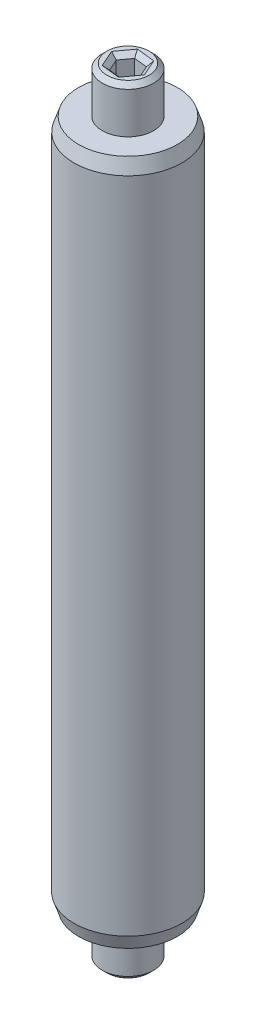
ISO-10303-21;
HEADER;
FILE_DESCRIPTION(('STEP AP214'),'2;1');
FILE_NAME('part.step','',(''),(''),'','','');
FILE_SCHEMA(('AUTOMOTIVE_DESIGN { 1 0 10303 214 1 1 1 1 }'));
ENDSEC;
DATA;
#1=APPLICATION_CONTEXT('core data for automotive mechanical design processes');
#2=APPLICATION_PROTOCOL_DEFINITION('international standard','automotive_design',2000,#1);
#3=PRODUCT_CONTEXT('',#1,'mechanical');
#4=PRODUCT('Part','Part','',(#3));
#5=PRODUCT_RELATED_PRODUCT_CATEGORY('part','',(#4));
#6=PRODUCT_DEFINITION_FORMATION('','',#4);
#7=PRODUCT_DEFINITION_CONTEXT('part definition',#1,'design');
#8=PRODUCT_DEFINITION('design','',#6,#7);
#9=PRODUCT_DEFINITION_SHAPE('','',#8);
#10=(LENGTH_UNIT() NAMED_UNIT(*) SI_UNIT(.MILLI.,.METRE.));
#11=(NAMED_UNIT(*) PLANE_ANGLE_UNIT() SI_UNIT($,.RADIAN.));
#12=(NAMED_UNIT(*) SI_UNIT($,.STERADIAN.) SOLID_ANGLE_UNIT());
#13=UNCERTAINTY_MEASURE_WITH_UNIT(LENGTH_MEASURE(1.E-05),#10,'distance_accuracy_value','');
#14=(GEOMETRIC_REPRESENTATION_CONTEXT(3) GLOBAL_UNCERTAINTY_ASSIGNED_CONTEXT((#13)) GLOBAL_UNIT_ASSIGNED_CONTEXT((#10,
#11,#12)) REPRESENTATION_CONTEXT('',''));
#15=CARTESIAN_POINT('',(0.,0.,0.));
#16=DIRECTION('',(0.,0.,1.));
#17=DIRECTION('',(1.,0.,0.));
#18=AXIS2_PLACEMENT_3D('',#15,#16,#17);
#19=CARTESIAN_POINT('',(-1.06592274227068,21.5359369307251,-1.12643595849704));
#20=DIRECTION('',(0.,-1.,0.));
#21=DIRECTION('',(0.,0.,-1.));
#22=AXIS2_PLACEMENT_3D('',#19,#20,#21);
#23=PLANE('',#22);
#24=CARTESIAN_POINT('',(-1.06592274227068,21.5359369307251,-1.12643595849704));
#25=DIRECTION('',(0.,-1.,0.));
#26=DIRECTION('',(0.,0.,-1.));
#27=AXIS2_PLACEMENT_3D('',#24,#25,#26);
#28=CIRCLE('',#27,1.3843);
#29=CARTESIAN_POINT('',(-1.06592274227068,21.5359369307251,-2.51073595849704));
#30=VERTEX_POINT('',#29);
#31=EDGE_CURVE('P0_E11',#30,#30,#28,.T.);
#32=ORIENTED_EDGE('',*,*,#31,.T.);
#33=EDGE_LOOP('',(#32));
#34=FACE_BOUND('',#33,.T.);
#35=CARTESIAN_POINT('',(-1.06592274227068,21.5359369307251,-1.12643595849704));
#36=DIRECTION('',(0.,1.,0.));
#37=DIRECTION('',(0.,0.,1.));
#38=AXIS2_PLACEMENT_3D('',#35,#36,#37);
#39=CIRCLE('',#38,2.74319999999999);
#40=CARTESIAN_POINT('',(-1.06592274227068,21.5359369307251,1.61676404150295));
#41=VERTEX_POINT('',#40);
#42=EDGE_CURVE('P0_E54',#41,#41,#39,.T.);
#43=ORIENTED_EDGE('',*,*,#42,.T.);
#44=EDGE_LOOP('',(#43));
#45=FACE_BOUND('',#44,.T.);
#46=ADVANCED_FACE('P0_F16',(#34,#45),#23,.F.);
#47=CARTESIAN_POINT('',(-1.06592274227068,20.7739369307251,-1.12643595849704));
#48=DIRECTION('',(0.,-1.,0.));
#49=DIRECTION('',(0.,0.,-1.));
#50=AXIS2_PLACEMENT_3D('',#47,#48,#49);
#51=CONICAL_SURFACE('',#50,2.9972,0.32175055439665);
#52=ORIENTED_EDGE('',*,*,#42,.F.);
#53=EDGE_LOOP('',(#52));
#54=FACE_BOUND('',#53,.T.);
#55=CARTESIAN_POINT('',(-1.06592274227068,20.7739369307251,-1.12643595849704));
#56=DIRECTION('',(0.,1.,0.));
#57=DIRECTION('',(0.,0.,1.));
#58=AXIS2_PLACEMENT_3D('',#55,#56,#57);
#59=CIRCLE('',#58,2.9972);
#60=CARTESIAN_POINT('',(-1.06592274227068,20.7739369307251,1.87076404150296));
#61=VERTEX_POINT('',#60);
#62=EDGE_CURVE('P0_E51',#61,#61,#59,.T.);
#63=ORIENTED_EDGE('',*,*,#62,.T.);
#64=EDGE_LOOP('',(#63));
#65=FACE_BOUND('',#64,.T.);
#66=ADVANCED_FACE('P0_F75',(#54,#65),#51,.T.);
#67=CARTESIAN_POINT('',(-1.06592274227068,21.5359369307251,-1.12643595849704));
#68=DIRECTION('',(0.,1.,0.));
#69=DIRECTION('',(0.,0.,1.));
#70=AXIS2_PLACEMENT_3D('',#67,#68,#69);
#71=CYLINDRICAL_SURFACE('',#70,2.9972);
#72=ORIENTED_EDGE('',*,*,#62,.F.);
#73=EDGE_LOOP('',(#72));
#74=FACE_BOUND('',#73,.T.);
#75=CARTESIAN_POINT('',(-1.06592274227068,-15.8020630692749,-1.12643595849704));
#76=DIRECTION('',(0.,1.,0.));
#77=DIRECTION('',(0.,0.,1.));
#78=AXIS2_PLACEMENT_3D('',#75,#76,#77);
#79=CIRCLE('',#78,2.9972);
#80=CARTESIAN_POINT('',(-1.06592274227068,-15.8020630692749,1.87076404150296));
#81=VERTEX_POINT('',#80);
#82=EDGE_CURVE('P0_E48',#81,#81,#79,.T.);
#83=ORIENTED_EDGE('',*,*,#82,.T.);
#84=EDGE_LOOP('',(#83));
#85=FACE_BOUND('',#84,.T.);
#86=ADVANCED_FACE('P0_F81',(#74,#85),#71,.T.);
#87=CARTESIAN_POINT('',(-1.06592274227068,-16.5640630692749,-1.12643595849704));
#88=DIRECTION('',(0.,1.,0.));
#89=DIRECTION('',(0.,0.,1.));
#90=AXIS2_PLACEMENT_3D('',#87,#88,#89);
#91=CONICAL_SURFACE('',#90,2.74319999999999,0.321750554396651);
#92=ORIENTED_EDGE('',*,*,#82,.F.);
#93=EDGE_LOOP('',(#92));
#94=FACE_BOUND('',#93,.T.);
#95=CARTESIAN_POINT('',(-1.06592274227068,-16.5640630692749,-1.12643595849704));
#96=DIRECTION('',(0.,1.,0.));
#97=DIRECTION('',(0.,0.,1.));
#98=AXIS2_PLACEMENT_3D('',#95,#96,#97);
#99=CIRCLE('',#98,2.74319999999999);
#100=CARTESIAN_POINT('',(-1.06592274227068,-16.5640630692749,1.61676404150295));
#101=VERTEX_POINT('',#100);
#102=EDGE_CURVE('P0_E43',#101,#101,#99,.T.);
#103=ORIENTED_EDGE('',*,*,#102,.T.);
#104=EDGE_LOOP('',(#103));
#105=FACE_BOUND('',#104,.T.);
#106=ADVANCED_FACE('P0_F88',(#94,#105),#91,.T.);
#107=CARTESIAN_POINT('',(1.67727725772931,-16.5640630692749,-1.12643595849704));
#108=DIRECTION('',(0.,1.,0.));
#109=DIRECTION('',(0.,0.,1.));
#110=AXIS2_PLACEMENT_3D('',#107,#108,#109);
#111=PLANE('',#110);
#112=CARTESIAN_POINT('',(-1.06592274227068,-16.5640630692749,-1.12643595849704));
#113=DIRECTION('',(0.,1.,0.));
#114=DIRECTION('',(0.,0.,1.));
#115=AXIS2_PLACEMENT_3D('',#112,#113,#114);
#116=CIRCLE('',#115,1.3843);
#117=CARTESIAN_POINT('',(-1.06592274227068,-16.5640630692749,0.257864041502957));
#118=VERTEX_POINT('',#117);
#119=EDGE_CURVE('P0_E60',#118,#118,#116,.T.);
#120=ORIENTED_EDGE('',*,*,#119,.T.);
#121=EDGE_LOOP('',(#120));
#122=FACE_BOUND('',#121,.T.);
#123=ORIENTED_EDGE('',*,*,#102,.F.);
#124=EDGE_LOOP('',(#123));
#125=FACE_BOUND('',#124,.T.);
#126=ADVANCED_FACE('P0_F92',(#122,#125),#111,.F.);
#127=CARTESIAN_POINT('',(-1.06592274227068,-16.5640630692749,-1.12643595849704));
#128=DIRECTION('',(0.,-1.,0.));
#129=DIRECTION('',(0.,0.,-1.));
#130=AXIS2_PLACEMENT_3D('',#127,#128,#129);
#131=CYLINDRICAL_SURFACE('',#130,1.1303);
#132=CARTESIAN_POINT('',(-1.06592274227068,-16.1241221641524,-1.12643595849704));
#133=DIRECTION('',(0.,1.,0.));
#134=DIRECTION('',(0.,0.,1.));
#135=AXIS2_PLACEMENT_3D('',#132,#133,#134);
#136=CIRCLE('',#135,1.1303);
#137=CARTESIAN_POINT('',(-1.06592274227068,-16.1241221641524,0.00386404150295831));
#138=VERTEX_POINT('',#137);
#139=EDGE_CURVE('P0_E57',#138,#138,#136,.F.);
#140=ORIENTED_EDGE('',*,*,#139,.T.);
#141=EDGE_LOOP('',(#140));
#142=FACE_BOUND('',#141,.T.);
#143=CARTESIAN_POINT('',(-1.06592274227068,-10.8490630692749,-1.12643595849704));
#144=DIRECTION('',(0.,-1.,0.));
#145=DIRECTION('',(0.,0.,-1.));
#146=AXIS2_PLACEMENT_3D('',#143,#144,#145);
#147=CIRCLE('',#146,1.1303);
#148=CARTESIAN_POINT('',(-1.06592274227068,-10.8490630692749,-2.25673595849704));
#149=VERTEX_POINT('',#148);
#150=EDGE_CURVE('P0_E40',#149,#149,#147,.T.);
#151=ORIENTED_EDGE('',*,*,#150,.F.);
#152=EDGE_LOOP('',(#151));
#153=FACE_BOUND('',#152,.T.);
#154=ADVANCED_FACE('P0_F96',(#142,#153),#131,.F.);
#155=CARTESIAN_POINT('',(-1.06592274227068,-10.8490630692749,-1.12643595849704));
#156=DIRECTION('',(0.,-1.,0.));
#157=DIRECTION('',(0.,0.,-1.));
#158=AXIS2_PLACEMENT_3D('',#155,#156,#157);
#159=CONICAL_SURFACE('',#158,1.1303,1.02974425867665);
#160=CARTESIAN_POINT('',(-1.06592274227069,-10.1699103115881,-1.12643595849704));
#161=VERTEX_POINT('',#160);
#162=VERTEX_LOOP('',#161);
#163=FACE_BOUND('',#162,.T.);
#164=ORIENTED_EDGE('',*,*,#150,.T.);
#165=EDGE_LOOP('',(#164));
#166=FACE_BOUND('',#165,.T.);
#167=ADVANCED_FACE('P0_F100',(#163,#166),#159,.F.);
#168=CARTESIAN_POINT('',(-1.06592274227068,21.5359369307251,-1.12643595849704));
#169=DIRECTION('',(0.,1.,0.));
#170=DIRECTION('',(0.,0.,1.));
#171=AXIS2_PLACEMENT_3D('',#168,#169,#170);
#172=CYLINDRICAL_SURFACE('',#171,1.1303);
#173=CARTESIAN_POINT('',(-1.06592274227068,21.0959960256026,-1.12643595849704));
#174=DIRECTION('',(0.,-1.,0.));
#175=DIRECTION('',(0.,0.,-1.));
#176=AXIS2_PLACEMENT_3D('',#173,#174,#175);
#177=CIRCLE('',#176,1.1303);
#178=CARTESIAN_POINT('',(-1.06592274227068,21.0959960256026,-2.25673595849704));
#179=VERTEX_POINT('',#178);
#180=EDGE_CURVE('P0_E24',#179,#179,#177,.F.);
#181=ORIENTED_EDGE('',*,*,#180,.T.);
#182=EDGE_LOOP('',(#181));
#183=FACE_BOUND('',#182,.T.);
#184=CARTESIAN_POINT('',(-1.06592274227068,15.8209369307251,-1.12643595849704));
#185=DIRECTION('',(0.,1.,0.));
#186=DIRECTION('',(0.,0.,1.));
#187=AXIS2_PLACEMENT_3D('',#184,#185,#186);
#188=CIRCLE('',#187,1.1303);
#189=CARTESIAN_POINT('',(-1.06592274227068,15.8209369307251,0.00386404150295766));
#190=VERTEX_POINT('',#189);
#191=EDGE_CURVE('P0_E38',#190,#190,#188,.T.);
#192=ORIENTED_EDGE('',*,*,#191,.F.);
#193=EDGE_LOOP('',(#192));
#194=FACE_BOUND('',#193,.T.);
#195=ADVANCED_FACE('P0_F34',(#183,#194),#172,.F.);
#196=CARTESIAN_POINT('',(-1.06592274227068,15.8209369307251,-1.12643595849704));
#197=DIRECTION('',(0.,1.,0.));
#198=DIRECTION('',(0.,0.,1.));
#199=AXIS2_PLACEMENT_3D('',#196,#197,#198);
#200=CONICAL_SURFACE('',#199,1.1303,1.02974425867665);
#201=CARTESIAN_POINT('',(-1.06592274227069,15.1417841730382,-1.12643595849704));
#202=VERTEX_POINT('',#201);
#203=VERTEX_LOOP('',#202);
#204=FACE_BOUND('',#203,.T.);
#205=ORIENTED_EDGE('',*,*,#191,.T.);
#206=EDGE_LOOP('',(#205));
#207=FACE_BOUND('',#206,.T.);
#208=ADVANCED_FACE('P0_F30',(#204,#207),#200,.F.);
#209=CARTESIAN_POINT('',(-1.06592274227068,-16.1241221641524,-1.12643595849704));
#210=DIRECTION('',(0.,-1.,0.));
#211=DIRECTION('',(0.,0.,-1.));
#212=AXIS2_PLACEMENT_3D('',#209,#210,#211);
#213=CONICAL_SURFACE('',#212,1.1303,0.523598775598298);
#214=ORIENTED_EDGE('',*,*,#119,.F.);
#215=EDGE_LOOP('',(#214));
#216=FACE_BOUND('',#215,.T.);
#217=ORIENTED_EDGE('',*,*,#139,.F.);
#218=EDGE_LOOP('',(#217));
#219=FACE_BOUND('',#218,.T.);
#220=ADVANCED_FACE('P0_F33',(#216,#219),#213,.F.);
#221=CARTESIAN_POINT('',(-1.06592274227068,21.0959960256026,-1.12643595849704));
#222=DIRECTION('',(0.,1.,0.));
#223=DIRECTION('',(0.,0.,1.));
#224=AXIS2_PLACEMENT_3D('',#221,#222,#223);
#225=CONICAL_SURFACE('',#224,1.1303,0.523598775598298);
#226=ORIENTED_EDGE('',*,*,#31,.F.);
#227=EDGE_LOOP('',(#226));
#228=FACE_BOUND('',#227,.T.);
#229=ORIENTED_EDGE('',*,*,#180,.F.);
#230=EDGE_LOOP('',(#229));
#231=FACE_BOUND('',#230,.T.);
#232=ADVANCED_FACE('P0_F18',(#228,#231),#225,.F.);
#233=CLOSED_SHELL('',(#46,#66,#86,#106,#126,#154,#167,#195,#208,#220,#232));
#234=MANIFOLD_SOLID_BREP('P0_B1',#233);
#235=CARTESIAN_POINT('',(-1.64154912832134,17.7259369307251,-2.42715730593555));
#236=DIRECTION('',(0.,1.,0.));
#237=DIRECTION('',(-0.914455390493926,0.,0.404686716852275));
#238=AXIS2_PLACEMENT_3D('',#235,#236,#237);
#239=PLANE('',#238);
#240=CARTESIAN_POINT('',(-1.06592274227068,17.7259369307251,-1.12643595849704));
#241=DIRECTION('',(0.,1.,0.));
#242=DIRECTION('',(-0.914455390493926,0.,0.404686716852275));
#243=AXIS2_PLACEMENT_3D('',#240,#241,#242);
#244=CIRCLE('',#243,1.1684);
#245=CARTESIAN_POINT('',(-2.13437242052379,17.7259369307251,-0.653599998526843));
#246=VERTEX_POINT('',#245);
#247=EDGE_CURVE('P1_E126',#246,#246,#244,.F.);
#248=ORIENTED_EDGE('',*,*,#247,.T.);
#249=EDGE_LOOP('',(#248));
#250=FACE_BOUND('',#249,.T.);
#251=ADVANCED_FACE('P1_F16',(#250),#239,.F.);
#252=CARTESIAN_POINT('',(-1.06592274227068,24.0759369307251,-1.12643595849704));
#253=DIRECTION('',(0.,-1.,0.));
#254=DIRECTION('',(0.914455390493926,0.,-0.404686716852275));
#255=AXIS2_PLACEMENT_3D('',#252,#253,#254);
#256=PLANE('',#255);
#257=DIRECTION('',(-0.589598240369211,0.,0.807696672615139));
#258=VECTOR('',#257,1.);
#259=CARTESIAN_POINT('',(-0.347880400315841,24.0759369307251,-0.602283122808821));
#260=LINE('',#259,#258);
#261=CARTESIAN_POINT('',(-0.04526061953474,24.0759369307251,-1.016845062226));
#262=VERTEX_POINT('',#261);
#263=CARTESIAN_POINT('',(-0.650500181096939,24.0759369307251,-0.187721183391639));
#264=VERTEX_POINT('',#263);
#265=EDGE_CURVE('P1_E157',#262,#264,#260,.T.);
#266=ORIENTED_EDGE('',*,*,#265,.T.);
#267=DIRECTION('',(-0.994284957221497,0.,-0.106758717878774));
#268=VECTOR('',#267,1.);
#269=CARTESIAN_POINT('',(-1.16083124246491,24.0759369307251,-0.242516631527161));
#270=LINE('',#269,#268);
#271=CARTESIAN_POINT('',(-1.67116230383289,24.0759369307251,-0.297312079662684));
#272=VERTEX_POINT('',#271);
#273=EDGE_CURVE('P1_E159',#264,#272,#270,.T.);
#274=ORIENTED_EDGE('',*,*,#273,.T.);
#275=DIRECTION('',(-0.404686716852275,0.,-0.914455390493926));
#276=VECTOR('',#275,1.);
#277=CARTESIAN_POINT('',(-1.87887358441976,24.0759369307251,-0.766669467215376));
#278=LINE('',#277,#276);
#279=CARTESIAN_POINT('',(-2.08658486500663,24.0759369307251,-1.23602685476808));
#280=VERTEX_POINT('',#279);
#281=EDGE_CURVE('P1_E149',#272,#280,#278,.T.);
#282=ORIENTED_EDGE('',*,*,#281,.T.);
#283=DIRECTION('',(0.589598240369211,0.,-0.807696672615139));
#284=VECTOR('',#283,1.);
#285=CARTESIAN_POINT('',(-1.78396508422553,24.0759369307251,-1.65058879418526));
#286=LINE('',#285,#284);
#287=CARTESIAN_POINT('',(-1.48134530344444,24.0759369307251,-2.06515073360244));
#288=VERTEX_POINT('',#287);
#289=EDGE_CURVE('P1_E151',#280,#288,#286,.T.);
#290=ORIENTED_EDGE('',*,*,#289,.T.);
#291=DIRECTION('',(0.994284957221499,0.,0.106758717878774));
#292=VECTOR('',#291,1.);
#293=CARTESIAN_POINT('',(-0.971014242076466,24.0759369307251,-2.01035528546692));
#294=LINE('',#293,#292);
#295=CARTESIAN_POINT('',(-0.460683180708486,24.0759369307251,-1.9555598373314));
#296=VERTEX_POINT('',#295);
#297=EDGE_CURVE('P1_E153',#288,#296,#294,.T.);
#298=ORIENTED_EDGE('',*,*,#297,.T.);
#299=DIRECTION('',(0.404686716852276,0.,0.914455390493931));
#300=VECTOR('',#299,1.);
#301=CARTESIAN_POINT('',(-0.252971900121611,24.0759369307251,-1.4862024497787));
#302=LINE('',#301,#300);
#303=EDGE_CURVE('P1_E155',#296,#262,#302,.T.);
#304=ORIENTED_EDGE('',*,*,#303,.T.);
#305=EDGE_LOOP('',(#266,#274,#282,#290,#298,#304));
#306=FACE_BOUND('',#305,.T.);
#307=CARTESIAN_POINT('',(-1.06592274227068,24.0759369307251,-1.12643595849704));
#308=DIRECTION('',(0.,-1.,0.));
#309=DIRECTION('',(0.914455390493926,0.,-0.404686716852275));
#310=AXIS2_PLACEMENT_3D('',#307,#308,#309);
#311=CIRCLE('',#310,1.1684);
#312=CARTESIAN_POINT('',(0.00252693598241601,24.0759369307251,-1.59927191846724));
#313=VERTEX_POINT('',#312);
#314=EDGE_CURVE('P1_E143',#313,#313,#311,.F.);
#315=ORIENTED_EDGE('',*,*,#314,.T.);
#316=EDGE_LOOP('',(#315));
#317=FACE_BOUND('',#316,.T.);
#318=ADVANCED_FACE('P1_F206',(#306,#317),#256,.F.);
#319=CARTESIAN_POINT('',(-1.06592274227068,17.7259369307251,-1.12643595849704));
#320=DIRECTION('',(0.,-1.,0.));
#321=DIRECTION('',(0.914455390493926,0.,-0.404686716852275));
#322=AXIS2_PLACEMENT_3D('',#319,#320,#321);
#323=CYLINDRICAL_SURFACE('',#322,1.4224);
#324=CARTESIAN_POINT('',(-1.06592274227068,17.9799369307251,-1.12643595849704));
#325=DIRECTION('',(0.,1.,0.));
#326=DIRECTION('',(-0.914455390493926,0.,0.404686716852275));
#327=AXIS2_PLACEMENT_3D('',#324,#325,#326);
#328=CIRCLE('',#327,1.4224);
#329=CARTESIAN_POINT('',(-2.36664408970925,17.9799369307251,-0.550809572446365));
#330=VERTEX_POINT('',#329);
#331=EDGE_CURVE('P1_E140',#330,#330,#328,.T.);
#332=ORIENTED_EDGE('',*,*,#331,.T.);
#333=EDGE_LOOP('',(#332));
#334=FACE_BOUND('',#333,.T.);
#335=CARTESIAN_POINT('',(-1.06592274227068,23.8219369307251,-1.12643595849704));
#336=DIRECTION('',(0.,-1.,0.));
#337=DIRECTION('',(0.914455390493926,0.,-0.404686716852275));
#338=AXIS2_PLACEMENT_3D('',#335,#336,#337);
#339=CIRCLE('',#338,1.4224);
#340=CARTESIAN_POINT('',(0.234798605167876,23.8219369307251,-1.70206234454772));
#341=VERTEX_POINT('',#340);
#342=EDGE_CURVE('P1_E137',#341,#341,#339,.T.);
#343=ORIENTED_EDGE('',*,*,#342,.T.);
#344=EDGE_LOOP('',(#343));
#345=FACE_BOUND('',#344,.T.);
#346=ADVANCED_FACE('P1_F224',(#334,#345),#323,.T.);
#347=CARTESIAN_POINT('',(-1.06592274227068,17.7259369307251,-1.12643595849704));
#348=DIRECTION('',(0.,1.,0.));
#349=DIRECTION('',(-0.914455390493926,0.,0.404686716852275));
#350=AXIS2_PLACEMENT_3D('',#347,#348,#349);
#351=CONICAL_SURFACE('',#350,1.1684,0.785398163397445);
#352=ORIENTED_EDGE('',*,*,#331,.F.);
#353=EDGE_LOOP('',(#352));
#354=FACE_BOUND('',#353,.T.);
#355=ORIENTED_EDGE('',*,*,#247,.F.);
#356=EDGE_LOOP('',(#355));
#357=FACE_BOUND('',#356,.T.);
#358=ADVANCED_FACE('P1_F227',(#354,#357),#351,.T.);
#359=CARTESIAN_POINT('',(-1.06592274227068,23.8219369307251,-1.12643595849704));
#360=DIRECTION('',(0.,-1.,0.));
#361=DIRECTION('',(0.914455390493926,0.,-0.404686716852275));
#362=AXIS2_PLACEMENT_3D('',#359,#360,#361);
#363=CONICAL_SURFACE('',#362,1.4224,0.78539816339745);
#364=ORIENTED_EDGE('',*,*,#314,.F.);
#365=EDGE_LOOP('',(#364));
#366=FACE_BOUND('',#365,.T.);
#367=ORIENTED_EDGE('',*,*,#342,.F.);
#368=EDGE_LOOP('',(#367));
#369=FACE_BOUND('',#368,.T.);
#370=ADVANCED_FACE('P1_F229',(#366,#369),#363,.T.);
#371=CARTESIAN_POINT('',(-0.769192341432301,22.8059369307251,-0.455925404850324));
#372=DIRECTION('',(0.807696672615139,0.,0.589598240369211));
#373=DIRECTION('',(0.589598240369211,0.,-0.807696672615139));
#374=AXIS2_PLACEMENT_3D('',#371,#372,#373);
#375=PLANE('',#374);
#376=DIRECTION('',(0.,1.,0.));
#377=VECTOR('',#376,1.);
#378=CARTESIAN_POINT('',(-0.769192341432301,22.8059369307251,-0.455925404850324));
#379=LINE('',#378,#377);
#380=CARTESIAN_POINT('',(-0.769192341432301,22.8059369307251,-0.455925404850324));
#381=VERTEX_POINT('',#380);
#382=CARTESIAN_POINT('',(-0.769192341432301,23.8219369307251,-0.455925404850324));
#383=VERTEX_POINT('',#382);
#384=EDGE_CURVE('P1_E124',#381,#383,#379,.T.);
#385=ORIENTED_EDGE('',*,*,#384,.T.);
#386=DIRECTION('',(0.589598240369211,0.,-0.807696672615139));
#387=VECTOR('',#386,1.);
#388=CARTESIAN_POINT('',(-0.769192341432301,23.8219369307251,-0.455925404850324));
#389=LINE('',#388,#387);
#390=CARTESIAN_POINT('',(-0.33687836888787,23.8219369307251,-1.04815674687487));
#391=VERTEX_POINT('',#390);
#392=EDGE_CURVE('P1_E93',#383,#391,#389,.T.);
#393=ORIENTED_EDGE('',*,*,#392,.T.);
#394=DIRECTION('',(0.,1.,0.));
#395=VECTOR('',#394,1.);
#396=CARTESIAN_POINT('',(-0.33687836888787,22.8059369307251,-1.04815674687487));
#397=LINE('',#396,#395);
#398=CARTESIAN_POINT('',(-0.33687836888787,22.8059369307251,-1.04815674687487));
#399=VERTEX_POINT('',#398);
#400=EDGE_CURVE('P1_E85',#399,#391,#397,.T.);
#401=ORIENTED_EDGE('',*,*,#400,.F.);
#402=DIRECTION('',(0.589598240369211,0.,-0.807696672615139));
#403=VECTOR('',#402,1.);
#404=CARTESIAN_POINT('',(-0.769192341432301,22.8059369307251,-0.455925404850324));
#405=LINE('',#404,#403);
#406=EDGE_CURVE('P1_E90',#381,#399,#405,.T.);
#407=ORIENTED_EDGE('',*,*,#406,.F.);
#408=EDGE_LOOP('',(#385,#393,#401,#407));
#409=FACE_BOUND('',#408,.T.);
#410=ADVANCED_FACE('P1_F88',(#409),#375,.F.);
#411=CARTESIAN_POINT('',(-1.49823671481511,22.8059369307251,-0.534204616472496));
#412=DIRECTION('',(-0.106758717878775,0.,0.994284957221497));
#413=DIRECTION('',(0.994284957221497,0.,0.106758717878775));
#414=AXIS2_PLACEMENT_3D('',#411,#412,#413);
#415=PLANE('',#414);
#416=DIRECTION('',(0.,1.,0.));
#417=VECTOR('',#416,1.);
#418=CARTESIAN_POINT('',(-1.49823671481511,22.8059369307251,-0.534204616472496));
#419=LINE('',#418,#417);
#420=CARTESIAN_POINT('',(-1.49823671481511,22.8059369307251,-0.534204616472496));
#421=VERTEX_POINT('',#420);
#422=CARTESIAN_POINT('',(-1.49823671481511,23.8219369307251,-0.534204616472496));
#423=VERTEX_POINT('',#422);
#424=EDGE_CURVE('P1_E127',#421,#423,#419,.T.);
#425=ORIENTED_EDGE('',*,*,#424,.T.);
#426=DIRECTION('',(0.994284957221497,0.,0.106758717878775));
#427=VECTOR('',#426,1.);
#428=CARTESIAN_POINT('',(-1.49823671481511,23.8219369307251,-0.534204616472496));
#429=LINE('',#428,#427);
#430=EDGE_CURVE('P1_E146',#423,#383,#429,.T.);
#431=ORIENTED_EDGE('',*,*,#430,.T.);
#432=ORIENTED_EDGE('',*,*,#384,.F.);
#433=DIRECTION('',(0.994284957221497,0.,0.106758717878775));
#434=VECTOR('',#433,1.);
#435=CARTESIAN_POINT('',(-1.49823671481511,22.8059369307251,-0.534204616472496));
#436=LINE('',#435,#434);
#437=EDGE_CURVE('P1_E97',#421,#381,#436,.T.);
#438=ORIENTED_EDGE('',*,*,#437,.F.);
#439=EDGE_LOOP('',(#425,#431,#432,#438));
#440=FACE_BOUND('',#439,.T.);
#441=ADVANCED_FACE('P1_F195',(#440),#415,.F.);
#442=CARTESIAN_POINT('',(-1.79496711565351,22.8059369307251,-1.20471517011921));
#443=DIRECTION('',(-0.914455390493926,0.,0.404686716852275));
#444=DIRECTION('',(0.404686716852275,0.,0.914455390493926));
#445=AXIS2_PLACEMENT_3D('',#442,#443,#444);
#446=PLANE('',#445);
#447=DIRECTION('',(0.,1.,0.));
#448=VECTOR('',#447,1.);
#449=CARTESIAN_POINT('',(-1.79496711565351,22.8059369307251,-1.20471517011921));
#450=LINE('',#449,#448);
#451=CARTESIAN_POINT('',(-1.79496711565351,22.8059369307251,-1.20471517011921));
#452=VERTEX_POINT('',#451);
#453=CARTESIAN_POINT('',(-1.79496711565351,23.8219369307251,-1.20471517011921));
#454=VERTEX_POINT('',#453);
#455=EDGE_CURVE('P1_E130',#452,#454,#450,.T.);
#456=ORIENTED_EDGE('',*,*,#455,.T.);
#457=DIRECTION('',(0.404686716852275,0.,0.914455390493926));
#458=VECTOR('',#457,1.);
#459=CARTESIAN_POINT('',(-1.79496711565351,23.8219369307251,-1.20471517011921));
#460=LINE('',#459,#458);
#461=EDGE_CURVE('P1_E11',#454,#423,#460,.T.);
#462=ORIENTED_EDGE('',*,*,#461,.T.);
#463=ORIENTED_EDGE('',*,*,#424,.F.);
#464=DIRECTION('',(0.404686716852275,0.,0.914455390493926));
#465=VECTOR('',#464,1.);
#466=CARTESIAN_POINT('',(-1.79496711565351,22.8059369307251,-1.20471517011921));
#467=LINE('',#466,#465);
#468=EDGE_CURVE('P1_E121',#452,#421,#467,.T.);
#469=ORIENTED_EDGE('',*,*,#468,.F.);
#470=EDGE_LOOP('',(#456,#462,#463,#469));
#471=FACE_BOUND('',#470,.T.);
#472=ADVANCED_FACE('P1_F251',(#471),#446,.F.);
#473=CARTESIAN_POINT('',(-1.36265314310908,22.8059369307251,-1.79694651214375));
#474=DIRECTION('',(-0.807696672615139,0.,-0.589598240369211));
#475=DIRECTION('',(-0.589598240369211,0.,0.807696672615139));
#476=AXIS2_PLACEMENT_3D('',#473,#474,#475);
#477=PLANE('',#476);
#478=DIRECTION('',(0.,1.,0.));
#479=VECTOR('',#478,1.);
#480=CARTESIAN_POINT('',(-1.36265314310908,22.8059369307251,-1.79694651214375));
#481=LINE('',#480,#479);
#482=CARTESIAN_POINT('',(-1.36265314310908,22.8059369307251,-1.79694651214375));
#483=VERTEX_POINT('',#482);
#484=CARTESIAN_POINT('',(-1.36265314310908,23.8219369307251,-1.79694651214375));
#485=VERTEX_POINT('',#484);
#486=EDGE_CURVE('P1_E132',#483,#485,#481,.T.);
#487=ORIENTED_EDGE('',*,*,#486,.T.);
#488=DIRECTION('',(-0.589598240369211,0.,0.807696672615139));
#489=VECTOR('',#488,1.);
#490=CARTESIAN_POINT('',(-1.36265314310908,23.8219369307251,-1.79694651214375));
#491=LINE('',#490,#489);
#492=EDGE_CURVE('P1_E23',#485,#454,#491,.T.);
#493=ORIENTED_EDGE('',*,*,#492,.T.);
#494=ORIENTED_EDGE('',*,*,#455,.F.);
#495=DIRECTION('',(-0.589598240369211,0.,0.807696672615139));
#496=VECTOR('',#495,1.);
#497=CARTESIAN_POINT('',(-1.36265314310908,22.8059369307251,-1.79694651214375));
#498=LINE('',#497,#496);
#499=EDGE_CURVE('P1_E118',#483,#452,#498,.T.);
#500=ORIENTED_EDGE('',*,*,#499,.F.);
#501=EDGE_LOOP('',(#487,#493,#494,#500));
#502=FACE_BOUND('',#501,.T.);
#503=ADVANCED_FACE('P1_F248',(#502),#477,.F.);
#504=CARTESIAN_POINT('',(-0.63360876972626,22.8059369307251,-1.71866730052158));
#505=DIRECTION('',(0.106758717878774,0.,-0.994284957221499));
#506=DIRECTION('',(-0.9942849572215,0.,-0.106758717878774));
#507=AXIS2_PLACEMENT_3D('',#504,#505,#506);
#508=PLANE('',#507);
#509=DIRECTION('',(0.,1.,0.));
#510=VECTOR('',#509,1.);
#511=CARTESIAN_POINT('',(-0.63360876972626,22.8059369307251,-1.71866730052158));
#512=LINE('',#511,#510);
#513=CARTESIAN_POINT('',(-0.63360876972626,22.8059369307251,-1.71866730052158));
#514=VERTEX_POINT('',#513);
#515=CARTESIAN_POINT('',(-0.63360876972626,23.8219369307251,-1.71866730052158));
#516=VERTEX_POINT('',#515);
#517=EDGE_CURVE('P1_E96',#514,#516,#512,.T.);
#518=ORIENTED_EDGE('',*,*,#517,.T.);
#519=DIRECTION('',(-0.9942849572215,0.,-0.106758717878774));
#520=VECTOR('',#519,1.);
#521=CARTESIAN_POINT('',(-0.63360876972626,23.8219369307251,-1.71866730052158));
#522=LINE('',#521,#520);
#523=EDGE_CURVE('P1_E37',#516,#485,#522,.T.);
#524=ORIENTED_EDGE('',*,*,#523,.T.);
#525=ORIENTED_EDGE('',*,*,#486,.F.);
#526=DIRECTION('',(-0.994284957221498,0.,-0.106758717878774));
#527=VECTOR('',#526,1.);
#528=CARTESIAN_POINT('',(-0.63360876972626,22.8059369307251,-1.71866730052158));
#529=LINE('',#528,#527);
#530=EDGE_CURVE('P1_E105',#514,#483,#529,.T.);
#531=ORIENTED_EDGE('',*,*,#530,.F.);
#532=EDGE_LOOP('',(#518,#524,#525,#531));
#533=FACE_BOUND('',#532,.T.);
#534=ADVANCED_FACE('P1_F169',(#533),#508,.F.);
#535=CARTESIAN_POINT('',(-0.33687836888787,22.8059369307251,-1.04815674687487));
#536=DIRECTION('',(0.914455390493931,0.,-0.404686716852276));
#537=DIRECTION('',(-0.404686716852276,0.,-0.914455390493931));
#538=AXIS2_PLACEMENT_3D('',#535,#536,#537);
#539=PLANE('',#538);
#540=ORIENTED_EDGE('',*,*,#400,.T.);
#541=DIRECTION('',(-0.404686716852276,0.,-0.914455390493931));
#542=VECTOR('',#541,1.);
#543=CARTESIAN_POINT('',(-0.33687836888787,23.8219369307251,-1.04815674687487));
#544=LINE('',#543,#542);
#545=EDGE_CURVE('P1_E163',#391,#516,#544,.T.);
#546=ORIENTED_EDGE('',*,*,#545,.T.);
#547=ORIENTED_EDGE('',*,*,#517,.F.);
#548=DIRECTION('',(-0.404686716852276,0.,-0.914455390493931));
#549=VECTOR('',#548,1.);
#550=CARTESIAN_POINT('',(-0.33687836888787,22.8059369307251,-1.04815674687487));
#551=LINE('',#550,#549);
#552=EDGE_CURVE('P1_E100',#399,#514,#551,.T.);
#553=ORIENTED_EDGE('',*,*,#552,.F.);
#554=EDGE_LOOP('',(#540,#546,#547,#553));
#555=FACE_BOUND('',#554,.T.);
#556=ADVANCED_FACE('P1_F101',(#555),#539,.F.);
#557=CARTESIAN_POINT('',(-1.20150631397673,22.8059369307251,0.136305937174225));
#558=DIRECTION('',(0.,-1.,0.));
#559=DIRECTION('',(0.914455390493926,0.,-0.404686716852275));
#560=AXIS2_PLACEMENT_3D('',#557,#558,#559);
#561=PLANE('',#560);
#562=ORIENTED_EDGE('',*,*,#406,.T.);
#563=ORIENTED_EDGE('',*,*,#552,.T.);
#564=ORIENTED_EDGE('',*,*,#530,.T.);
#565=ORIENTED_EDGE('',*,*,#499,.T.);
#566=ORIENTED_EDGE('',*,*,#468,.T.);
#567=ORIENTED_EDGE('',*,*,#437,.T.);
#568=EDGE_LOOP('',(#562,#563,#564,#565,#566,#567));
#569=FACE_BOUND('',#568,.T.);
#570=ADVANCED_FACE('P1_F107',(#569),#561,.F.);
#571=CARTESIAN_POINT('',(-0.63360876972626,23.8219369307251,-1.71866730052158));
#572=DIRECTION('',(0.0754898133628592,-0.707106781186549,-0.703065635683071));
#573=DIRECTION('',(0.305914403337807,-0.654653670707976,0.691263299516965));
#574=AXIS2_PLACEMENT_3D('',#571,#572,#573);
#575=PLANE('',#574);
#576=DIRECTION('',(0.445694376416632,0.654653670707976,-0.610561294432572));
#577=VECTOR('',#576,1.);
#578=CARTESIAN_POINT('',(-0.757127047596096,23.6405083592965,-1.54945834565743));
#579=LINE('',#578,#577);
#580=EDGE_CURVE('P1_E113',#296,#516,#579,.F.);
#581=ORIENTED_EDGE('',*,*,#580,.F.);
#582=ORIENTED_EDGE('',*,*,#297,.F.);
#583=DIRECTION('',(-0.305914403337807,0.654653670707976,-0.691263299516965));
#584=VECTOR('',#583,1.);
#585=CARTESIAN_POINT('',(-1.27787302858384,23.6405083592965,-1.60537206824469));
#586=LINE('',#585,#584);
#587=EDGE_CURVE('P1_E110',#485,#288,#586,.T.);
#588=ORIENTED_EDGE('',*,*,#587,.F.);
#589=ORIENTED_EDGE('',*,*,#523,.F.);
#590=EDGE_LOOP('',(#581,#582,#588,#589));
#591=FACE_BOUND('',#590,.T.);
#592=ADVANCED_FACE('P1_F173',(#591),#575,.F.);
#593=CARTESIAN_POINT('',(-1.36265314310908,23.8219369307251,-1.79694651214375));
#594=DIRECTION('',(-0.571127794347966,-0.707106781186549,-0.416908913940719));
#595=DIRECTION('',(0.305914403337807,-0.654653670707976,0.691263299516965));
#596=AXIS2_PLACEMENT_3D('',#593,#594,#595);
#597=PLANE('',#596);
#598=ORIENTED_EDGE('',*,*,#587,.T.);
#599=ORIENTED_EDGE('',*,*,#289,.F.);
#600=DIRECTION('',(-0.751608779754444,0.654653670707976,-0.0807020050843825));
#601=VECTOR('',#600,1.);
#602=CARTESIAN_POINT('',(-1.58666872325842,23.6405083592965,-1.1823496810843));
#603=LINE('',#602,#601);
#604=EDGE_CURVE('P1_E177',#454,#280,#603,.T.);
#605=ORIENTED_EDGE('',*,*,#604,.F.);
#606=ORIENTED_EDGE('',*,*,#492,.F.);
#607=EDGE_LOOP('',(#598,#599,#605,#606));
#608=FACE_BOUND('',#607,.T.);
#609=ADVANCED_FACE('P1_F209',(#608),#597,.F.);
#610=CARTESIAN_POINT('',(-0.33687836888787,23.8219369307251,-1.04815674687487));
#611=DIRECTION('',(0.646617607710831,-0.707106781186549,-0.286156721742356));
#612=DIRECTION('',(0.646617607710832,0.707106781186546,-0.286156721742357));
#613=AXIS2_PLACEMENT_3D('',#610,#611,#612);
#614=PLANE('',#613);
#615=ORIENTED_EDGE('',*,*,#580,.T.);
#616=ORIENTED_EDGE('',*,*,#545,.F.);
#617=DIRECTION('',(0.751608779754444,0.654653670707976,0.0807020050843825));
#618=VECTOR('',#617,1.);
#619=CARTESIAN_POINT('',(-0.545176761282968,23.6405083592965,-1.07052223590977));
#620=LINE('',#619,#618);
#621=EDGE_CURVE('P1_E179',#262,#391,#620,.F.);
#622=ORIENTED_EDGE('',*,*,#621,.F.);
#623=ORIENTED_EDGE('',*,*,#303,.F.);
#624=EDGE_LOOP('',(#615,#616,#622,#623));
#625=FACE_BOUND('',#624,.T.);
#626=ADVANCED_FACE('P1_F176',(#625),#614,.F.);
#627=CARTESIAN_POINT('',(-1.79496711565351,23.8219369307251,-1.20471517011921));
#628=DIRECTION('',(-0.646617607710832,-0.707106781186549,0.286156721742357));
#629=DIRECTION('',(0.646617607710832,-0.707106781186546,-0.286156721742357));
#630=AXIS2_PLACEMENT_3D('',#627,#628,#629);
#631=PLANE('',#630);
#632=ORIENTED_EDGE('',*,*,#604,.T.);
#633=ORIENTED_EDGE('',*,*,#281,.F.);
#634=DIRECTION('',(0.445694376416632,-0.654653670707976,-0.610561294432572));
#635=VECTOR('',#634,1.);
#636=CARTESIAN_POINT('',(-1.49823671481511,23.8219369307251,-0.534204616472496));
#637=LINE('',#636,#635);
#638=EDGE_CURVE('P1_E183',#423,#272,#637,.F.);
#639=ORIENTED_EDGE('',*,*,#638,.F.);
#640=ORIENTED_EDGE('',*,*,#461,.F.);
#641=EDGE_LOOP('',(#632,#633,#639,#640));
#642=FACE_BOUND('',#641,.T.);
#643=ADVANCED_FACE('P1_F202',(#642),#631,.F.);
#644=CARTESIAN_POINT('',(-0.769192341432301,23.8219369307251,-0.455925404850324));
#645=DIRECTION('',(0.571127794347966,-0.707106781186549,0.416908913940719));
#646=DIRECTION('',(0.305914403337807,0.654653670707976,0.691263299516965));
#647=AXIS2_PLACEMENT_3D('',#644,#645,#646);
#648=PLANE('',#647);
#649=ORIENTED_EDGE('',*,*,#621,.T.);
#650=ORIENTED_EDGE('',*,*,#392,.F.);
#651=DIRECTION('',(0.305914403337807,0.654653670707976,0.691263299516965));
#652=VECTOR('',#651,1.);
#653=CARTESIAN_POINT('',(-0.853972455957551,23.6405083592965,-0.647499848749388));
#654=LINE('',#653,#652);
#655=EDGE_CURVE('P1_E185',#264,#383,#654,.F.);
#656=ORIENTED_EDGE('',*,*,#655,.F.);
#657=ORIENTED_EDGE('',*,*,#265,.F.);
#658=EDGE_LOOP('',(#649,#650,#656,#657));
#659=FACE_BOUND('',#658,.T.);
#660=ADVANCED_FACE('P1_F193',(#659),#648,.F.);
#661=CARTESIAN_POINT('',(-1.49823671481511,23.8219369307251,-0.534204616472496));
#662=DIRECTION('',(-0.07548981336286,-0.707106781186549,0.703065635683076));
#663=DIRECTION('',(0.305914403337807,0.654653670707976,0.691263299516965));
#664=AXIS2_PLACEMENT_3D('',#661,#662,#663);
#665=PLANE('',#664);
#666=ORIENTED_EDGE('',*,*,#638,.T.);
#667=ORIENTED_EDGE('',*,*,#273,.F.);
#668=ORIENTED_EDGE('',*,*,#655,.T.);
#669=ORIENTED_EDGE('',*,*,#430,.F.);
#670=EDGE_LOOP('',(#666,#667,#668,#669));
#671=FACE_BOUND('',#670,.T.);
#672=ADVANCED_FACE('P1_F190',(#671),#665,.F.);
#673=CLOSED_SHELL('',(#251,#318,#346,#358,#370,#410,#441,#472,#503,#534,#556,#570,#592,#609,
#626,#643,#660,#672));
#674=MANIFOLD_SOLID_BREP('P1_B1',#673);
#675=CARTESIAN_POINT('',(0.124866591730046,-12.7540630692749,-0.348462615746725));
#676=DIRECTION('',(0.,-1.,0.));
#677=DIRECTION('',(-0.546944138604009,0.,0.837169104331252));
#678=AXIS2_PLACEMENT_3D('',#675,#676,#677);
#679=PLANE('',#678);
#680=CARTESIAN_POINT('',(-1.06592274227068,-12.7540630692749,-1.12643595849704));
#681=DIRECTION('',(0.,-1.,0.));
#682=DIRECTION('',(-0.546944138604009,0.,0.837169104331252));
#683=AXIS2_PLACEMENT_3D('',#680,#681,#682);
#684=CIRCLE('',#683,1.1684);
#685=CARTESIAN_POINT('',(-1.70497227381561,-12.7540630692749,-0.148287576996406));
#686=VERTEX_POINT('',#685);
#687=EDGE_CURVE('P2_E126',#686,#686,#684,.F.);
#688=ORIENTED_EDGE('',*,*,#687,.T.);
#689=EDGE_LOOP('',(#688));
#690=FACE_BOUND('',#689,.T.);
#691=ADVANCED_FACE('P2_F16',(#690),#679,.F.);
#692=CARTESIAN_POINT('',(-1.06592274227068,-19.1040630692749,-1.12643595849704));
#693=DIRECTION('',(0.,1.,0.));
#694=DIRECTION('',(0.546944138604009,0.,-0.837169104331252));
#695=AXIS2_PLACEMENT_3D('',#692,#693,#694);
#696=PLANE('',#695);
#697=DIRECTION('',(-0.892252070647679,0.,0.451537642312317));
#698=VECTOR('',#697,1.);
#699=CARTESIAN_POINT('',(-1.46733970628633,-19.1040630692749,-1.91964804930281));
#700=LINE('',#699,#698);
#701=CARTESIAN_POINT('',(-1.00937849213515,-19.1040630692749,-2.15140624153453));
#702=VERTEX_POINT('',#701);
#703=CARTESIAN_POINT('',(-1.92530092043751,-19.1040630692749,-1.6878898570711));
#704=VERTEX_POINT('',#703);
#705=EDGE_CURVE('P2_E157',#702,#704,#700,.T.);
#706=ORIENTED_EDGE('',*,*,#705,.T.);
#707=DIRECTION('',(-0.0550829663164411,0.,0.998481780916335));
#708=VECTOR('',#707,1.);
#709=CARTESIAN_POINT('',(-1.95357304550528,-19.1040630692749,-1.17540471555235));
#710=LINE('',#709,#708);
#711=CARTESIAN_POINT('',(-1.98184517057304,-19.1040630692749,-0.662919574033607));
#712=VERTEX_POINT('',#711);
#713=EDGE_CURVE('P2_E159',#704,#712,#710,.T.);
#714=ORIENTED_EDGE('',*,*,#713,.T.);
#715=DIRECTION('',(0.837169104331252,0.,0.546944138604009));
#716=VECTOR('',#715,1.);
#717=CARTESIAN_POINT('',(-1.55215608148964,-19.1040630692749,-0.382192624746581));
#718=LINE('',#717,#716);
#719=CARTESIAN_POINT('',(-1.12246699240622,-19.1040630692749,-0.101465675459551));
#720=VERTEX_POINT('',#719);
#721=EDGE_CURVE('P2_E149',#712,#720,#718,.T.);
#722=ORIENTED_EDGE('',*,*,#721,.T.);
#723=DIRECTION('',(0.892252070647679,0.,-0.451537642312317));
#724=VECTOR('',#723,1.);
#725=CARTESIAN_POINT('',(-0.664505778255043,-19.1040630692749,-0.333223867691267));
#726=LINE('',#725,#724);
#727=CARTESIAN_POINT('',(-0.206544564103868,-19.1040630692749,-0.564982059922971));
#728=VERTEX_POINT('',#727);
#729=EDGE_CURVE('P2_E151',#720,#728,#726,.T.);
#730=ORIENTED_EDGE('',*,*,#729,.T.);
#731=DIRECTION('',(0.0550829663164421,0.,-0.998481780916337));
#732=VECTOR('',#731,1.);
#733=CARTESIAN_POINT('',(-0.178272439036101,-19.1040630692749,-1.07746720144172));
#734=LINE('',#733,#732);
#735=CARTESIAN_POINT('',(-0.150000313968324,-19.1040630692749,-1.58995234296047));
#736=VERTEX_POINT('',#735);
#737=EDGE_CURVE('P2_E153',#728,#736,#734,.T.);
#738=ORIENTED_EDGE('',*,*,#737,.T.);
#739=DIRECTION('',(-0.837169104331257,0.,-0.546944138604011));
#740=VECTOR('',#739,1.);
#741=CARTESIAN_POINT('',(-0.579689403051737,-19.1040630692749,-1.8706792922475));
#742=LINE('',#741,#740);
#743=EDGE_CURVE('P2_E155',#736,#702,#742,.T.);
#744=ORIENTED_EDGE('',*,*,#743,.T.);
#745=EDGE_LOOP('',(#706,#714,#722,#730,#738,#744));
#746=FACE_BOUND('',#745,.T.);
#747=CARTESIAN_POINT('',(-1.06592274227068,-19.1040630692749,-1.12643595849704));
#748=DIRECTION('',(0.,1.,0.));
#749=DIRECTION('',(0.546944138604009,0.,-0.837169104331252));
#750=AXIS2_PLACEMENT_3D('',#747,#748,#749);
#751=CIRCLE('',#750,1.1684);
#752=CARTESIAN_POINT('',(-0.426873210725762,-19.1040630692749,-2.10458433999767));
#753=VERTEX_POINT('',#752);
#754=EDGE_CURVE('P2_E143',#753,#753,#751,.F.);
#755=ORIENTED_EDGE('',*,*,#754,.T.);
#756=EDGE_LOOP('',(#755));
#757=FACE_BOUND('',#756,.T.);
#758=ADVANCED_FACE('P2_F206',(#746,#757),#696,.F.);
#759=CARTESIAN_POINT('',(-1.06592274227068,-12.7540630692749,-1.12643595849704));
#760=DIRECTION('',(0.,1.,0.));
#761=DIRECTION('',(0.546944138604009,0.,-0.837169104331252));
#762=AXIS2_PLACEMENT_3D('',#759,#760,#761);
#763=CYLINDRICAL_SURFACE('',#762,1.4224);
#764=CARTESIAN_POINT('',(-1.06592274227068,-13.0080630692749,-1.12643595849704));
#765=DIRECTION('',(0.,-1.,0.));
#766=DIRECTION('',(-0.546944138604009,0.,0.837169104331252));
#767=AXIS2_PLACEMENT_3D('',#764,#765,#766);
#768=CIRCLE('',#767,1.4224);
#769=CARTESIAN_POINT('',(-1.84389608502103,-13.0080630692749,0.064353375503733));
#770=VERTEX_POINT('',#769);
#771=EDGE_CURVE('P2_E140',#770,#770,#768,.T.);
#772=ORIENTED_EDGE('',*,*,#771,.T.);
#773=EDGE_LOOP('',(#772));
#774=FACE_BOUND('',#773,.T.);
#775=CARTESIAN_POINT('',(-1.06592274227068,-18.8500630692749,-1.12643595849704));
#776=DIRECTION('',(0.,1.,0.));
#777=DIRECTION('',(0.546944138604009,0.,-0.837169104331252));
#778=AXIS2_PLACEMENT_3D('',#775,#776,#777);
#779=CIRCLE('',#778,1.4224);
#780=CARTESIAN_POINT('',(-0.287949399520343,-18.8500630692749,-2.31722529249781));
#781=VERTEX_POINT('',#780);
#782=EDGE_CURVE('P2_E137',#781,#781,#779,.T.);
#783=ORIENTED_EDGE('',*,*,#782,.T.);
#784=EDGE_LOOP('',(#783));
#785=FACE_BOUND('',#784,.T.);
#786=ADVANCED_FACE('P2_F224',(#774,#785),#763,.T.);
#787=CARTESIAN_POINT('',(-1.06592274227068,-12.7540630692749,-1.12643595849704));
#788=DIRECTION('',(0.,-1.,0.));
#789=DIRECTION('',(-0.546944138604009,0.,0.837169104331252));
#790=AXIS2_PLACEMENT_3D('',#787,#788,#789);
#791=CONICAL_SURFACE('',#790,1.1684,0.785398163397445);
#792=ORIENTED_EDGE('',*,*,#771,.F.);
#793=EDGE_LOOP('',(#792));
#794=FACE_BOUND('',#793,.T.);
#795=ORIENTED_EDGE('',*,*,#687,.F.);
#796=EDGE_LOOP('',(#795));
#797=FACE_BOUND('',#796,.T.);
#798=ADVANCED_FACE('P2_F227',(#794,#797),#791,.T.);
#799=CARTESIAN_POINT('',(-1.06592274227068,-18.8500630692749,-1.12643595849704));
#800=DIRECTION('',(0.,1.,0.));
#801=DIRECTION('',(0.546944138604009,0.,-0.837169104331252));
#802=AXIS2_PLACEMENT_3D('',#799,#800,#801);
#803=CONICAL_SURFACE('',#802,1.4224,0.78539816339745);
#804=ORIENTED_EDGE('',*,*,#754,.F.);
#805=EDGE_LOOP('',(#804));
#806=FACE_BOUND('',#805,.T.);
#807=ORIENTED_EDGE('',*,*,#782,.F.);
#808=EDGE_LOOP('',(#807));
#809=FACE_BOUND('',#808,.T.);
#810=ADVANCED_FACE('P2_F229',(#806,#809),#803,.T.);
#811=CARTESIAN_POINT('',(-1.67976429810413,-17.8340630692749,-1.52747445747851));
#812=DIRECTION('',(-0.451537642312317,0.,-0.892252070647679));
#813=DIRECTION('',(0.892252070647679,0.,-0.451537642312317));
#814=AXIS2_PLACEMENT_3D('',#811,#812,#813);
#815=PLANE('',#814);
#816=DIRECTION('',(0.,-1.,0.));
#817=VECTOR('',#816,1.);
#818=CARTESIAN_POINT('',(-1.67976429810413,-17.8340630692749,-1.52747445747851));
#819=LINE('',#818,#817);
#820=CARTESIAN_POINT('',(-1.67976429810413,-17.8340630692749,-1.52747445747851));
#821=VERTEX_POINT('',#820);
#822=CARTESIAN_POINT('',(-1.67976429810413,-18.8500630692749,-1.52747445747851));
#823=VERTEX_POINT('',#822);
#824=EDGE_CURVE('P2_E124',#821,#823,#819,.T.);
#825=ORIENTED_EDGE('',*,*,#824,.T.);
#826=DIRECTION('',(0.892252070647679,0.,-0.451537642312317));
#827=VECTOR('',#826,1.);
#828=CARTESIAN_POINT('',(-1.67976429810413,-18.8500630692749,-1.52747445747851));
#829=LINE('',#828,#827);
#830=CARTESIAN_POINT('',(-1.02553399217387,-18.8500630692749,-1.8585575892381));
#831=VERTEX_POINT('',#830);
#832=EDGE_CURVE('P2_E93',#823,#831,#829,.T.);
#833=ORIENTED_EDGE('',*,*,#832,.T.);
#834=DIRECTION('',(0.,-1.,0.));
#835=VECTOR('',#834,1.);
#836=CARTESIAN_POINT('',(-1.02553399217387,-17.8340630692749,-1.8585575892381));
#837=LINE('',#836,#835);
#838=CARTESIAN_POINT('',(-1.02553399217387,-17.8340630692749,-1.8585575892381));
#839=VERTEX_POINT('',#838);
#840=EDGE_CURVE('P2_E85',#839,#831,#837,.T.);
#841=ORIENTED_EDGE('',*,*,#840,.F.);
#842=DIRECTION('',(0.892252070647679,0.,-0.451537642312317));
#843=VECTOR('',#842,1.);
#844=CARTESIAN_POINT('',(-1.67976429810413,-17.8340630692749,-1.52747445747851));
#845=LINE('',#844,#843);
#846=EDGE_CURVE('P2_E90',#821,#839,#845,.T.);
#847=ORIENTED_EDGE('',*,*,#846,.F.);
#848=EDGE_LOOP('',(#825,#833,#841,#847));
#849=FACE_BOUND('',#848,.T.);
#850=ADVANCED_FACE('P2_F88',(#849),#815,.F.);
#851=CARTESIAN_POINT('',(-1.72015304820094,-17.8340630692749,-0.795352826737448));
#852=DIRECTION('',(-0.998481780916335,0.,-0.055082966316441));
#853=DIRECTION('',(0.055082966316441,0.,-0.998481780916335));
#854=AXIS2_PLACEMENT_3D('',#851,#852,#853);
#855=PLANE('',#854);
#856=DIRECTION('',(0.,-1.,0.));
#857=VECTOR('',#856,1.);
#858=CARTESIAN_POINT('',(-1.72015304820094,-17.8340630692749,-0.795352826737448));
#859=LINE('',#858,#857);
#860=CARTESIAN_POINT('',(-1.72015304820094,-17.8340630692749,-0.795352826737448));
#861=VERTEX_POINT('',#860);
#862=CARTESIAN_POINT('',(-1.72015304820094,-18.8500630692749,-0.795352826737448));
#863=VERTEX_POINT('',#862);
#864=EDGE_CURVE('P2_E127',#861,#863,#859,.T.);
#865=ORIENTED_EDGE('',*,*,#864,.T.);
#866=DIRECTION('',(0.055082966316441,0.,-0.998481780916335));
#867=VECTOR('',#866,1.);
#868=CARTESIAN_POINT('',(-1.72015304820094,-18.8500630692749,-0.795352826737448));
#869=LINE('',#868,#867);
#870=EDGE_CURVE('P2_E146',#863,#823,#869,.T.);
#871=ORIENTED_EDGE('',*,*,#870,.T.);
#872=ORIENTED_EDGE('',*,*,#824,.F.);
#873=DIRECTION('',(0.055082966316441,0.,-0.998481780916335));
#874=VECTOR('',#873,1.);
#875=CARTESIAN_POINT('',(-1.72015304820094,-17.8340630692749,-0.795352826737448));
#876=LINE('',#875,#874);
#877=EDGE_CURVE('P2_E97',#861,#821,#876,.T.);
#878=ORIENTED_EDGE('',*,*,#877,.F.);
#879=EDGE_LOOP('',(#865,#871,#872,#878));
#880=FACE_BOUND('',#879,.T.);
#881=ADVANCED_FACE('P2_F195',(#880),#855,.F.);
#882=CARTESIAN_POINT('',(-1.1063114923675,-17.8340630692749,-0.394314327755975));
#883=DIRECTION('',(-0.546944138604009,0.,0.837169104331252));
#884=DIRECTION('',(-0.837169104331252,0.,-0.546944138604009));
#885=AXIS2_PLACEMENT_3D('',#882,#883,#884);
#886=PLANE('',#885);
#887=DIRECTION('',(0.,-1.,0.));
#888=VECTOR('',#887,1.);
#889=CARTESIAN_POINT('',(-1.1063114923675,-17.8340630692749,-0.394314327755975));
#890=LINE('',#889,#888);
#891=CARTESIAN_POINT('',(-1.1063114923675,-17.8340630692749,-0.394314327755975));
#892=VERTEX_POINT('',#891);
#893=CARTESIAN_POINT('',(-1.1063114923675,-18.8500630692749,-0.394314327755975));
#894=VERTEX_POINT('',#893);
#895=EDGE_CURVE('P2_E130',#892,#894,#890,.T.);
#896=ORIENTED_EDGE('',*,*,#895,.T.);
#897=DIRECTION('',(-0.837169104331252,0.,-0.546944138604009));
#898=VECTOR('',#897,1.);
#899=CARTESIAN_POINT('',(-1.1063114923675,-18.8500630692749,-0.394314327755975));
#900=LINE('',#899,#898);
#901=EDGE_CURVE('P2_E11',#894,#863,#900,.T.);
#902=ORIENTED_EDGE('',*,*,#901,.T.);
#903=ORIENTED_EDGE('',*,*,#864,.F.);
#904=DIRECTION('',(-0.837169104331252,0.,-0.546944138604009));
#905=VECTOR('',#904,1.);
#906=CARTESIAN_POINT('',(-1.1063114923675,-17.8340630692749,-0.394314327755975));
#907=LINE('',#906,#905);
#908=EDGE_CURVE('P2_E121',#892,#861,#907,.T.);
#909=ORIENTED_EDGE('',*,*,#908,.F.);
#910=EDGE_LOOP('',(#896,#902,#903,#909));
#911=FACE_BOUND('',#910,.T.);
#912=ADVANCED_FACE('P2_F251',(#911),#886,.F.);
#913=CARTESIAN_POINT('',(-0.452081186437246,-17.8340630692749,-0.725397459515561));
#914=DIRECTION('',(0.451537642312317,0.,0.892252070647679));
#915=DIRECTION('',(-0.892252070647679,0.,0.451537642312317));
#916=AXIS2_PLACEMENT_3D('',#913,#914,#915);
#917=PLANE('',#916);
#918=DIRECTION('',(0.,-1.,0.));
#919=VECTOR('',#918,1.);
#920=CARTESIAN_POINT('',(-0.452081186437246,-17.8340630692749,-0.725397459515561));
#921=LINE('',#920,#919);
#922=CARTESIAN_POINT('',(-0.452081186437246,-17.8340630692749,-0.725397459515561));
#923=VERTEX_POINT('',#922);
#924=CARTESIAN_POINT('',(-0.452081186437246,-18.8500630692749,-0.725397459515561));
#925=VERTEX_POINT('',#924);
#926=EDGE_CURVE('P2_E132',#923,#925,#921,.T.);
#927=ORIENTED_EDGE('',*,*,#926,.T.);
#928=DIRECTION('',(-0.892252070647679,0.,0.451537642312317));
#929=VECTOR('',#928,1.);
#930=CARTESIAN_POINT('',(-0.452081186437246,-18.8500630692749,-0.725397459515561));
#931=LINE('',#930,#929);
#932=EDGE_CURVE('P2_E23',#925,#894,#931,.T.);
#933=ORIENTED_EDGE('',*,*,#932,.T.);
#934=ORIENTED_EDGE('',*,*,#895,.F.);
#935=DIRECTION('',(-0.892252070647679,0.,0.451537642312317));
#936=VECTOR('',#935,1.);
#937=CARTESIAN_POINT('',(-0.452081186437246,-17.8340630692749,-0.725397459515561));
#938=LINE('',#937,#936);
#939=EDGE_CURVE('P2_E118',#923,#892,#938,.T.);
#940=ORIENTED_EDGE('',*,*,#939,.F.);
#941=EDGE_LOOP('',(#927,#933,#934,#940));
#942=FACE_BOUND('',#941,.T.);
#943=ADVANCED_FACE('P2_F248',(#942),#917,.F.);
#944=CARTESIAN_POINT('',(-0.411692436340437,-17.8340630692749,-1.45751909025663));
#945=DIRECTION('',(0.998481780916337,0.,0.0550829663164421));
#946=DIRECTION('',(-0.0550829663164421,0.,0.998481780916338));
#947=AXIS2_PLACEMENT_3D('',#944,#945,#946);
#948=PLANE('',#947);
#949=DIRECTION('',(0.,-1.,0.));
#950=VECTOR('',#949,1.);
#951=CARTESIAN_POINT('',(-0.411692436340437,-17.8340630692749,-1.45751909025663));
#952=LINE('',#951,#950);
#953=CARTESIAN_POINT('',(-0.411692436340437,-17.8340630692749,-1.45751909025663));
#954=VERTEX_POINT('',#953);
#955=CARTESIAN_POINT('',(-0.411692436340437,-18.8500630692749,-1.45751909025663));
#956=VERTEX_POINT('',#955);
#957=EDGE_CURVE('P2_E96',#954,#956,#952,.T.);
#958=ORIENTED_EDGE('',*,*,#957,.T.);
#959=DIRECTION('',(-0.0550829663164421,0.,0.998481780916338));
#960=VECTOR('',#959,1.);
#961=CARTESIAN_POINT('',(-0.411692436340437,-18.8500630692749,-1.45751909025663));
#962=LINE('',#961,#960);
#963=EDGE_CURVE('P2_E37',#956,#925,#962,.T.);
#964=ORIENTED_EDGE('',*,*,#963,.T.);
#965=ORIENTED_EDGE('',*,*,#926,.F.);
#966=DIRECTION('',(-0.055082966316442,0.,0.998481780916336));
#967=VECTOR('',#966,1.);
#968=CARTESIAN_POINT('',(-0.411692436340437,-17.8340630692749,-1.45751909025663));
#969=LINE('',#968,#967);
#970=EDGE_CURVE('P2_E105',#954,#923,#969,.T.);
#971=ORIENTED_EDGE('',*,*,#970,.F.);
#972=EDGE_LOOP('',(#958,#964,#965,#971));
#973=FACE_BOUND('',#972,.T.);
#974=ADVANCED_FACE('P2_F169',(#973),#948,.F.);
#975=CARTESIAN_POINT('',(-1.02553399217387,-17.8340630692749,-1.8585575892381));
#976=DIRECTION('',(0.546944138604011,0.,-0.837169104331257));
#977=DIRECTION('',(0.837169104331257,0.,0.546944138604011));
#978=AXIS2_PLACEMENT_3D('',#975,#976,#977);
#979=PLANE('',#978);
#980=ORIENTED_EDGE('',*,*,#840,.T.);
#981=DIRECTION('',(0.837169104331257,0.,0.546944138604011));
#982=VECTOR('',#981,1.);
#983=CARTESIAN_POINT('',(-1.02553399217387,-18.8500630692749,-1.8585575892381));
#984=LINE('',#983,#982);
#985=EDGE_CURVE('P2_E163',#831,#956,#984,.T.);
#986=ORIENTED_EDGE('',*,*,#985,.T.);
#987=ORIENTED_EDGE('',*,*,#957,.F.);
#988=DIRECTION('',(0.837169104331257,0.,0.546944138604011));
#989=VECTOR('',#988,1.);
#990=CARTESIAN_POINT('',(-1.02553399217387,-17.8340630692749,-1.8585575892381));
#991=LINE('',#990,#989);
#992=EDGE_CURVE('P2_E100',#839,#954,#991,.T.);
#993=ORIENTED_EDGE('',*,*,#992,.F.);
#994=EDGE_LOOP('',(#980,#986,#987,#993));
#995=FACE_BOUND('',#994,.T.);
#996=ADVANCED_FACE('P2_F101',(#995),#979,.F.);
#997=CARTESIAN_POINT('',(-2.3339946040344,-17.8340630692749,-1.19639132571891));
#998=DIRECTION('',(0.,1.,0.));
#999=DIRECTION('',(0.546944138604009,0.,-0.837169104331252));
#1000=AXIS2_PLACEMENT_3D('',#997,#998,#999);
#1001=PLANE('',#1000);
#1002=ORIENTED_EDGE('',*,*,#846,.T.);
#1003=ORIENTED_EDGE('',*,*,#992,.T.);
#1004=ORIENTED_EDGE('',*,*,#970,.T.);
#1005=ORIENTED_EDGE('',*,*,#939,.T.);
#1006=ORIENTED_EDGE('',*,*,#908,.T.);
#1007=ORIENTED_EDGE('',*,*,#877,.T.);
#1008=EDGE_LOOP('',(#1002,#1003,#1004,#1005,#1006,#1007));
#1009=FACE_BOUND('',#1008,.T.);
#1010=ADVANCED_FACE('P2_F107',(#1009),#1001,.F.);
#1011=CARTESIAN_POINT('',(-0.411692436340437,-18.8500630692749,-1.45751909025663));
#1012=DIRECTION('',(0.706033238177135,0.707106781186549,0.0389495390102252));
#1013=DIRECTION('',(-0.632840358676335,0.654653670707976,-0.413450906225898));
#1014=AXIS2_PLACEMENT_3D('',#1011,#1012,#1013);
#1015=PLANE('',#1014);
#1016=DIRECTION('',(0.674479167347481,-0.654653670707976,-0.341330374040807));
#1017=VECTOR('',#1016,1.);
#1018=CARTESIAN_POINT('',(-0.598615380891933,-18.6686344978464,-1.36292390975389));
#1019=LINE('',#1018,#1017);
#1020=EDGE_CURVE('P2_E113',#736,#956,#1019,.F.);
#1021=ORIENTED_EDGE('',*,*,#1020,.F.);
#1022=ORIENTED_EDGE('',*,*,#737,.F.);
#1023=DIRECTION('',(0.632840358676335,-0.654653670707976,0.413450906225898));
#1024=VECTOR('',#1023,1.);
#1025=CARTESIAN_POINT('',(-0.627464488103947,-18.6686344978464,-0.839979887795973));
#1026=LINE('',#1025,#1024);
#1027=EDGE_CURVE('P2_E110',#925,#728,#1026,.T.);
#1028=ORIENTED_EDGE('',*,*,#1027,.F.);
#1029=ORIENTED_EDGE('',*,*,#963,.F.);
#1030=EDGE_LOOP('',(#1021,#1022,#1028,#1029));
#1031=FACE_BOUND('',#1030,.T.);
#1032=ADVANCED_FACE('P2_F173',(#1031),#1015,.F.);
#1033=CARTESIAN_POINT('',(-0.452081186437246,-18.8500630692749,-0.725397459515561));
#1034=DIRECTION('',(0.319285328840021,0.707106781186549,0.630917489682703));
#1035=DIRECTION('',(-0.632840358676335,0.654653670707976,-0.413450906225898));
#1036=AXIS2_PLACEMENT_3D('',#1033,#1034,#1035);
#1037=PLANE('',#1036);
#1038=ORIENTED_EDGE('',*,*,#1027,.T.);
#1039=ORIENTED_EDGE('',*,*,#729,.F.);
#1040=DIRECTION('',(-0.0416388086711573,-0.654653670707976,0.754781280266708));
#1041=VECTOR('',#1040,1.);
#1042=CARTESIAN_POINT('',(-1.0947718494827,-18.6686344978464,-0.603491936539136));
#1043=LINE('',#1042,#1041);
#1044=EDGE_CURVE('P2_E177',#894,#720,#1043,.T.);
#1045=ORIENTED_EDGE('',*,*,#1044,.F.);
#1046=ORIENTED_EDGE('',*,*,#932,.F.);
#1047=EDGE_LOOP('',(#1038,#1039,#1045,#1046));
#1048=FACE_BOUND('',#1047,.T.);
#1049=ADVANCED_FACE('P2_F209',(#1048),#1037,.F.);
#1050=CARTESIAN_POINT('',(-1.02553399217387,-18.8500630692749,-1.8585575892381));
#1051=DIRECTION('',(0.386747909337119,0.707106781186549,-0.591967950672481));
#1052=DIRECTION('',(0.38674790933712,-0.707106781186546,-0.591967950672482));
#1053=AXIS2_PLACEMENT_3D('',#1050,#1051,#1052);
#1054=PLANE('',#1053);
#1055=ORIENTED_EDGE('',*,*,#1020,.T.);
#1056=ORIENTED_EDGE('',*,*,#985,.F.);
#1057=DIRECTION('',(0.0416388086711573,-0.654653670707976,-0.754781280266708));
#1058=VECTOR('',#1057,1.);
#1059=CARTESIAN_POINT('',(-1.03707363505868,-18.6686344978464,-1.64937998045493));
#1060=LINE('',#1059,#1058);
#1061=EDGE_CURVE('P2_E179',#702,#831,#1060,.F.);
#1062=ORIENTED_EDGE('',*,*,#1061,.F.);
#1063=ORIENTED_EDGE('',*,*,#743,.F.);
#1064=EDGE_LOOP('',(#1055,#1056,#1062,#1063));
#1065=FACE_BOUND('',#1064,.T.);
#1066=ADVANCED_FACE('P2_F176',(#1065),#1054,.F.);
#1067=CARTESIAN_POINT('',(-1.1063114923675,-18.8500630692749,-0.394314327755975));
#1068=DIRECTION('',(-0.38674790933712,0.707106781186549,0.591967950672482));
#1069=DIRECTION('',(0.38674790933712,0.707106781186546,-0.591967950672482));
#1070=AXIS2_PLACEMENT_3D('',#1067,#1068,#1069);
#1071=PLANE('',#1070);
#1072=ORIENTED_EDGE('',*,*,#1044,.T.);
#1073=ORIENTED_EDGE('',*,*,#721,.F.);
#1074=DIRECTION('',(0.674479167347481,0.654653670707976,-0.341330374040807));
#1075=VECTOR('',#1074,1.);
#1076=CARTESIAN_POINT('',(-1.72015304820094,-18.8500630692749,-0.795352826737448));
#1077=LINE('',#1076,#1075);
#1078=EDGE_CURVE('P2_E183',#863,#712,#1077,.F.);
#1079=ORIENTED_EDGE('',*,*,#1078,.F.);
#1080=ORIENTED_EDGE('',*,*,#901,.F.);
#1081=EDGE_LOOP('',(#1072,#1073,#1079,#1080));
#1082=FACE_BOUND('',#1081,.T.);
#1083=ADVANCED_FACE('P2_F202',(#1082),#1071,.F.);
#1084=CARTESIAN_POINT('',(-1.67976429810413,-18.8500630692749,-1.52747445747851));
#1085=DIRECTION('',(-0.319285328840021,0.707106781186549,-0.630917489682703));
#1086=DIRECTION('',(-0.632840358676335,-0.654653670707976,-0.413450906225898));
#1087=AXIS2_PLACEMENT_3D('',#1084,#1085,#1086);
#1088=PLANE('',#1087);
#1089=ORIENTED_EDGE('',*,*,#1061,.T.);
#1090=ORIENTED_EDGE('',*,*,#832,.F.);
#1091=DIRECTION('',(-0.632840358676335,-0.654653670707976,-0.413450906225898));
#1092=VECTOR('',#1091,1.);
#1093=CARTESIAN_POINT('',(-1.50438099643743,-18.6686344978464,-1.41289202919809));
#1094=LINE('',#1093,#1092);
#1095=EDGE_CURVE('P2_E185',#704,#823,#1094,.F.);
#1096=ORIENTED_EDGE('',*,*,#1095,.F.);
#1097=ORIENTED_EDGE('',*,*,#705,.F.);
#1098=EDGE_LOOP('',(#1089,#1090,#1096,#1097));
#1099=FACE_BOUND('',#1098,.T.);
#1100=ADVANCED_FACE('P2_F193',(#1099),#1088,.F.);
#1101=CARTESIAN_POINT('',(-1.72015304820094,-18.8500630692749,-0.795352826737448));
#1102=DIRECTION('',(-0.706033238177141,0.707106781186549,-0.0389495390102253));
#1103=DIRECTION('',(-0.632840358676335,-0.654653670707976,-0.413450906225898));
#1104=AXIS2_PLACEMENT_3D('',#1101,#1102,#1103);
#1105=PLANE('',#1104);
#1106=ORIENTED_EDGE('',*,*,#1078,.T.);
#1107=ORIENTED_EDGE('',*,*,#713,.F.);
#1108=ORIENTED_EDGE('',*,*,#1095,.T.);
#1109=ORIENTED_EDGE('',*,*,#870,.F.);
#1110=EDGE_LOOP('',(#1106,#1107,#1108,#1109));
#1111=FACE_BOUND('',#1110,.T.);
#1112=ADVANCED_FACE('P2_F190',(#1111),#1105,.F.);
#1113=CLOSED_SHELL('',(#691,#758,#786,#798,#810,#850,#881,#912,#943,#974,#996,#1010,#1032,#1049,
#1066,#1083,#1100,#1112));
#1114=MANIFOLD_SOLID_BREP('P2_B1',#1113);
#1115=ADVANCED_BREP_SHAPE_REPRESENTATION('',(#18,#234,#674,#1114),#14);
#1116=SHAPE_DEFINITION_REPRESENTATION(#9,#1115);
ENDSEC;
END-ISO-10303-21;
